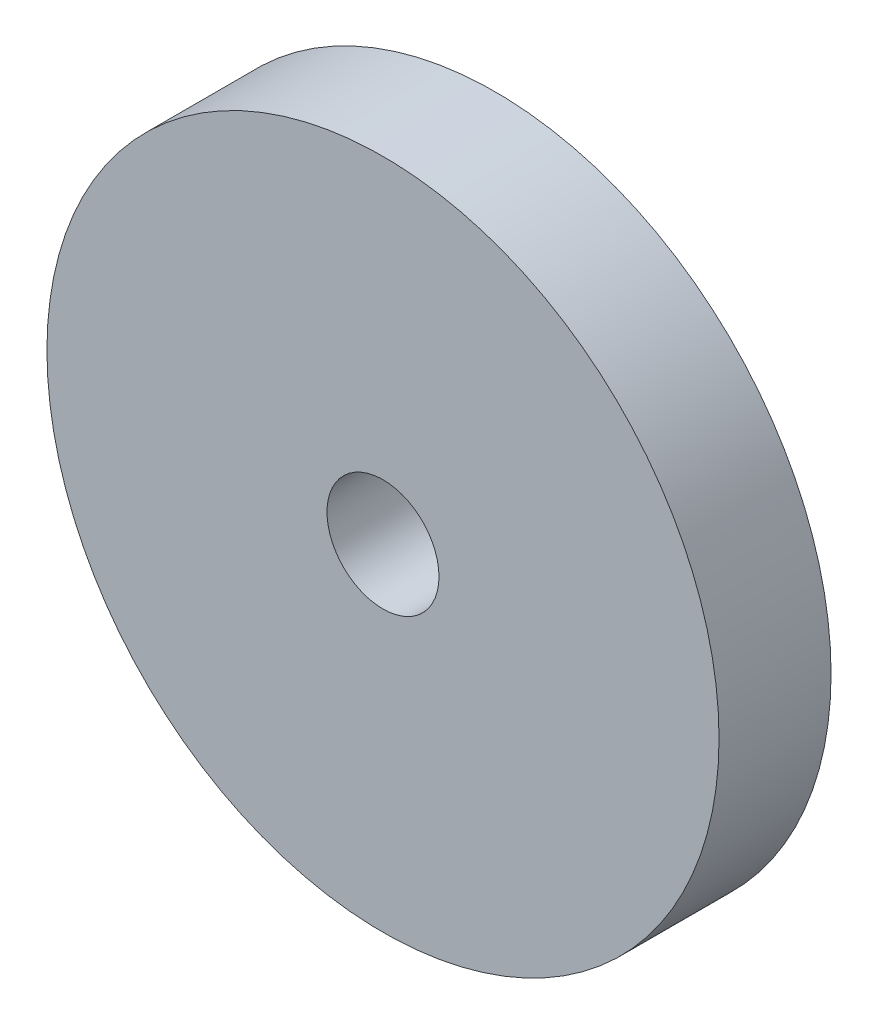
ISO-10303-21;
HEADER;
FILE_DESCRIPTION(('STEP AP214'),'2;1');
FILE_NAME('part.step','',(''),(''),'','','');
FILE_SCHEMA(('AUTOMOTIVE_DESIGN { 1 0 10303 214 1 1 1 1 }'));
ENDSEC;
DATA;
#1=APPLICATION_CONTEXT('core data for automotive mechanical design processes');
#2=APPLICATION_PROTOCOL_DEFINITION('international standard','automotive_design',2000,#1);
#3=PRODUCT_CONTEXT('',#1,'mechanical');
#4=PRODUCT('Part','Part','',(#3));
#5=PRODUCT_RELATED_PRODUCT_CATEGORY('part','',(#4));
#6=PRODUCT_DEFINITION_FORMATION('','',#4);
#7=PRODUCT_DEFINITION_CONTEXT('part definition',#1,'design');
#8=PRODUCT_DEFINITION('design','',#6,#7);
#9=PRODUCT_DEFINITION_SHAPE('','',#8);
#10=(LENGTH_UNIT() NAMED_UNIT(*) SI_UNIT(.MILLI.,.METRE.));
#11=(NAMED_UNIT(*) PLANE_ANGLE_UNIT() SI_UNIT($,.RADIAN.));
#12=(NAMED_UNIT(*) SI_UNIT($,.STERADIAN.) SOLID_ANGLE_UNIT());
#13=UNCERTAINTY_MEASURE_WITH_UNIT(LENGTH_MEASURE(1.E-05),#10,'distance_accuracy_value','');
#14=(GEOMETRIC_REPRESENTATION_CONTEXT(3) GLOBAL_UNCERTAINTY_ASSIGNED_CONTEXT((#13)) GLOBAL_UNIT_ASSIGNED_CONTEXT((#10,
#11,#12)) REPRESENTATION_CONTEXT('',''));
#15=CARTESIAN_POINT('',(0.,0.,0.));
#16=DIRECTION('',(0.,0.,1.));
#17=DIRECTION('',(1.,0.,0.));
#18=AXIS2_PLACEMENT_3D('',#15,#16,#17);
#19=CARTESIAN_POINT('',(0.,0.,6.35));
#20=DIRECTION('',(0.,0.,1.));
#21=DIRECTION('',(1.,0.,0.));
#22=AXIS2_PLACEMENT_3D('',#19,#20,#21);
#23=PLANE('',#22);
#24=CARTESIAN_POINT('',(0.,0.,6.35));
#25=DIRECTION('',(0.,0.,1.));
#26=DIRECTION('',(1.,0.,0.));
#27=AXIS2_PLACEMENT_3D('',#24,#25,#26);
#28=CIRCLE('',#27,19.05);
#29=CARTESIAN_POINT('',(19.05,0.,6.35));
#30=VERTEX_POINT('',#29);
#31=EDGE_CURVE('E10',#30,#30,#28,.T.);
#32=ORIENTED_EDGE('',*,*,#31,.T.);
#33=EDGE_LOOP('',(#32));
#34=FACE_BOUND('',#33,.T.);
#35=CARTESIAN_POINT('',(0.,0.,6.35));
#36=DIRECTION('',(0.,0.,1.));
#37=DIRECTION('',(1.,0.,0.));
#38=AXIS2_PLACEMENT_3D('',#35,#36,#37);
#39=CIRCLE('',#38,3.175);
#40=CARTESIAN_POINT('',(3.175,0.,6.35));
#41=VERTEX_POINT('',#40);
#42=EDGE_CURVE('E42',#41,#41,#39,.T.);
#43=ORIENTED_EDGE('',*,*,#42,.F.);
#44=EDGE_LOOP('',(#43));
#45=FACE_BOUND('',#44,.T.);
#46=ADVANCED_FACE('F31',(#34,#45),#23,.T.);
#47=CARTESIAN_POINT('',(0.,0.,0.));
#48=DIRECTION('',(0.,0.,1.));
#49=DIRECTION('',(1.,0.,0.));
#50=AXIS2_PLACEMENT_3D('',#47,#48,#49);
#51=PLANE('',#50);
#52=CARTESIAN_POINT('',(0.,0.,0.));
#53=DIRECTION('',(0.,0.,1.));
#54=DIRECTION('',(1.,0.,0.));
#55=AXIS2_PLACEMENT_3D('',#52,#53,#54);
#56=CIRCLE('',#55,19.05);
#57=CARTESIAN_POINT('',(19.05,0.,0.));
#58=VERTEX_POINT('',#57);
#59=EDGE_CURVE('E35',#58,#58,#56,.T.);
#60=ORIENTED_EDGE('',*,*,#59,.F.);
#61=EDGE_LOOP('',(#60));
#62=FACE_BOUND('',#61,.T.);
#63=CARTESIAN_POINT('',(0.,0.,0.));
#64=DIRECTION('',(0.,0.,1.));
#65=DIRECTION('',(1.,0.,0.));
#66=AXIS2_PLACEMENT_3D('',#63,#64,#65);
#67=CIRCLE('',#66,3.175);
#68=CARTESIAN_POINT('',(3.175,0.,0.));
#69=VERTEX_POINT('',#68);
#70=EDGE_CURVE('E44',#69,#69,#67,.T.);
#71=ORIENTED_EDGE('',*,*,#70,.T.);
#72=EDGE_LOOP('',(#71));
#73=FACE_BOUND('',#72,.T.);
#74=ADVANCED_FACE('F54',(#62,#73),#51,.F.);
#75=CARTESIAN_POINT('',(0.,0.,6.35));
#76=DIRECTION('',(0.,0.,-1.));
#77=DIRECTION('',(-1.,0.,0.));
#78=AXIS2_PLACEMENT_3D('',#75,#76,#77);
#79=CYLINDRICAL_SURFACE('',#78,19.05);
#80=ORIENTED_EDGE('',*,*,#31,.F.);
#81=EDGE_LOOP('',(#80));
#82=FACE_BOUND('',#81,.T.);
#83=ORIENTED_EDGE('',*,*,#59,.T.);
#84=EDGE_LOOP('',(#83));
#85=FACE_BOUND('',#84,.T.);
#86=ADVANCED_FACE('F33',(#82,#85),#79,.T.);
#87=CARTESIAN_POINT('',(0.,0.,6.35));
#88=DIRECTION('',(0.,0.,-1.));
#89=DIRECTION('',(-1.,0.,0.));
#90=AXIS2_PLACEMENT_3D('',#87,#88,#89);
#91=CYLINDRICAL_SURFACE('',#90,3.175);
#92=ORIENTED_EDGE('',*,*,#42,.T.);
#93=EDGE_LOOP('',(#92));
#94=FACE_BOUND('',#93,.T.);
#95=ORIENTED_EDGE('',*,*,#70,.F.);
#96=EDGE_LOOP('',(#95));
#97=FACE_BOUND('',#96,.T.);
#98=ADVANCED_FACE('F50',(#94,#97),#91,.F.);
#99=CLOSED_SHELL('',(#46,#74,#86,#98));
#100=MANIFOLD_SOLID_BREP('B2',#99);
#101=ADVANCED_BREP_SHAPE_REPRESENTATION('',(#18,#100),#14);
#102=SHAPE_DEFINITION_REPRESENTATION(#9,#101);
ENDSEC;
END-ISO-10303-21;
